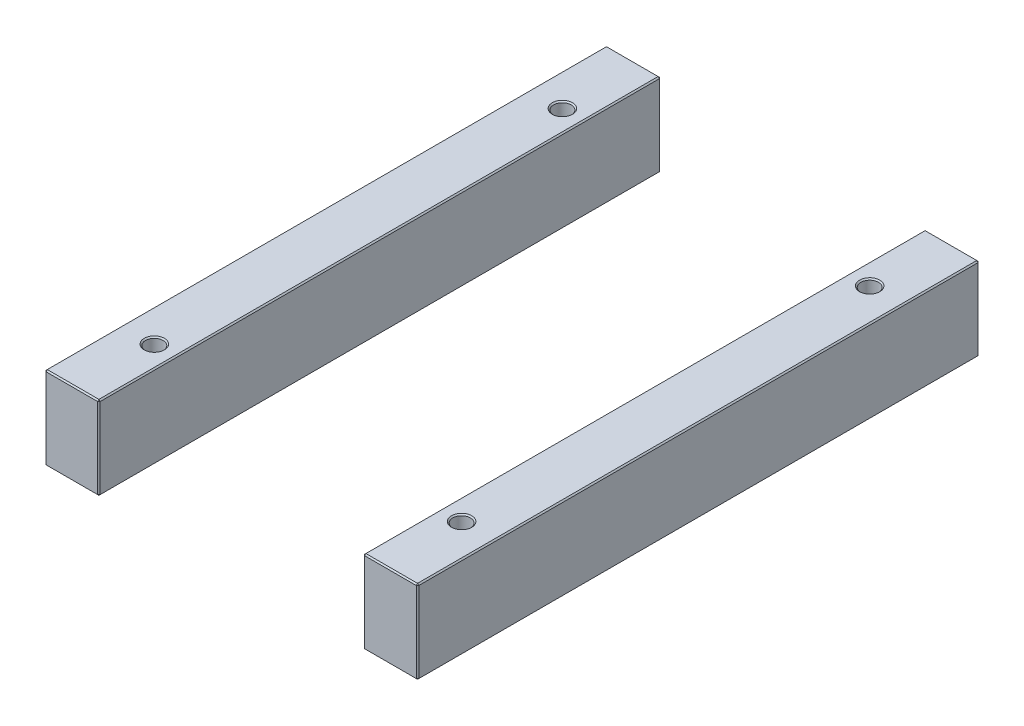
ISO-10303-21;
HEADER;
FILE_DESCRIPTION(('STEP AP214'),'2;1');
FILE_NAME('part.step','',(''),(''),'','','');
FILE_SCHEMA(('AUTOMOTIVE_DESIGN { 1 0 10303 214 1 1 1 1 }'));
ENDSEC;
DATA;
#1=APPLICATION_CONTEXT('core data for automotive mechanical design processes');
#2=APPLICATION_PROTOCOL_DEFINITION('international standard','automotive_design',2000,#1);
#3=PRODUCT_CONTEXT('',#1,'mechanical');
#4=PRODUCT('Part','Part','',(#3));
#5=PRODUCT_RELATED_PRODUCT_CATEGORY('part','',(#4));
#6=PRODUCT_DEFINITION_FORMATION('','',#4);
#7=PRODUCT_DEFINITION_CONTEXT('part definition',#1,'design');
#8=PRODUCT_DEFINITION('design','',#6,#7);
#9=PRODUCT_DEFINITION_SHAPE('','',#8);
#10=(LENGTH_UNIT() NAMED_UNIT(*) SI_UNIT(.MILLI.,.METRE.));
#11=(NAMED_UNIT(*) PLANE_ANGLE_UNIT() SI_UNIT($,.RADIAN.));
#12=(NAMED_UNIT(*) SI_UNIT($,.STERADIAN.) SOLID_ANGLE_UNIT());
#13=UNCERTAINTY_MEASURE_WITH_UNIT(LENGTH_MEASURE(1.E-05),#10,'distance_accuracy_value','');
#14=(GEOMETRIC_REPRESENTATION_CONTEXT(3) GLOBAL_UNCERTAINTY_ASSIGNED_CONTEXT((#13)) GLOBAL_UNIT_ASSIGNED_CONTEXT((#10,
#11,#12)) REPRESENTATION_CONTEXT('',''));
#15=CARTESIAN_POINT('',(0.,0.,0.));
#16=DIRECTION('',(0.,0.,1.));
#17=DIRECTION('',(1.,0.,0.));
#18=AXIS2_PLACEMENT_3D('',#15,#16,#17);
#19=CARTESIAN_POINT('',(-148.,66.,-223.));
#20=DIRECTION('',(0.,0.,1.));
#21=DIRECTION('',(1.,0.,0.));
#22=AXIS2_PLACEMENT_3D('',#19,#20,#21);
#23=PLANE('',#22);
#24=DIRECTION('',(-1.,0.,0.));
#25=VECTOR('',#24,1.);
#26=CARTESIAN_POINT('',(-148.,0.999999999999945,-223.));
#27=LINE('',#26,#25);
#28=CARTESIAN_POINT('',(-106.,0.999999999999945,-223.));
#29=VERTEX_POINT('',#28);
#30=CARTESIAN_POINT('',(-147.,0.999999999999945,-223.));
#31=VERTEX_POINT('',#30);
#32=EDGE_CURVE('P0_E137',#29,#31,#27,.T.);
#33=ORIENTED_EDGE('',*,*,#32,.T.);
#34=DIRECTION('',(0.,1.,0.));
#35=VECTOR('',#34,1.);
#36=CARTESIAN_POINT('',(-147.,66.,-223.));
#37=LINE('',#36,#35);
#38=CARTESIAN_POINT('',(-147.,65.,-223.));
#39=VERTEX_POINT('',#38);
#40=EDGE_CURVE('P0_E235',#31,#39,#37,.T.);
#41=ORIENTED_EDGE('',*,*,#40,.T.);
#42=DIRECTION('',(1.,0.,0.));
#43=VECTOR('',#42,1.);
#44=CARTESIAN_POINT('',(-148.,65.,-223.));
#45=LINE('',#44,#43);
#46=CARTESIAN_POINT('',(-106.,65.,-223.));
#47=VERTEX_POINT('',#46);
#48=EDGE_CURVE('P0_E233',#39,#47,#45,.T.);
#49=ORIENTED_EDGE('',*,*,#48,.T.);
#50=DIRECTION('',(0.,-1.,0.));
#51=VECTOR('',#50,1.);
#52=CARTESIAN_POINT('',(-106.,66.,-223.));
#53=LINE('',#52,#51);
#54=EDGE_CURVE('P0_E230',#47,#29,#53,.T.);
#55=ORIENTED_EDGE('',*,*,#54,.T.);
#56=EDGE_LOOP('',(#33,#41,#49,#55));
#57=FACE_BOUND('',#56,.T.);
#58=ADVANCED_FACE('P0_F16',(#57),#23,.F.);
#59=CARTESIAN_POINT('',(-148.,66.,223.));
#60=DIRECTION('',(1.,0.,0.));
#61=DIRECTION('',(0.,0.,-1.));
#62=AXIS2_PLACEMENT_3D('',#59,#60,#61);
#63=PLANE('',#62);
#64=DIRECTION('',(0.,1.,0.));
#65=VECTOR('',#64,1.);
#66=CARTESIAN_POINT('',(-148.,66.,222.));
#67=LINE('',#66,#65);
#68=CARTESIAN_POINT('',(-148.,0.999999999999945,222.));
#69=VERTEX_POINT('',#68);
#70=CARTESIAN_POINT('',(-148.,65.,222.));
#71=VERTEX_POINT('',#70);
#72=EDGE_CURVE('P0_E217',#69,#71,#67,.T.);
#73=ORIENTED_EDGE('',*,*,#72,.T.);
#74=DIRECTION('',(0.,0.,-1.));
#75=VECTOR('',#74,1.);
#76=CARTESIAN_POINT('',(-148.,65.,223.));
#77=LINE('',#76,#75);
#78=CARTESIAN_POINT('',(-148.,65.,-222.));
#79=VERTEX_POINT('',#78);
#80=EDGE_CURVE('P0_E228',#71,#79,#77,.T.);
#81=ORIENTED_EDGE('',*,*,#80,.T.);
#82=DIRECTION('',(0.,-1.,0.));
#83=VECTOR('',#82,1.);
#84=CARTESIAN_POINT('',(-148.,66.,-222.));
#85=LINE('',#84,#83);
#86=CARTESIAN_POINT('',(-148.,0.999999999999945,-222.));
#87=VERTEX_POINT('',#86);
#88=EDGE_CURVE('P0_E225',#79,#87,#85,.T.);
#89=ORIENTED_EDGE('',*,*,#88,.T.);
#90=DIRECTION('',(0.,0.,1.));
#91=VECTOR('',#90,1.);
#92=CARTESIAN_POINT('',(-148.,0.999999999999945,223.));
#93=LINE('',#92,#91);
#94=EDGE_CURVE('P0_E214',#87,#69,#93,.T.);
#95=ORIENTED_EDGE('',*,*,#94,.T.);
#96=EDGE_LOOP('',(#73,#81,#89,#95));
#97=FACE_BOUND('',#96,.T.);
#98=ADVANCED_FACE('P0_F302',(#97),#63,.F.);
#99=CARTESIAN_POINT('',(-148.,66.,223.));
#100=DIRECTION('',(0.,0.,-1.));
#101=DIRECTION('',(-1.,0.,0.));
#102=AXIS2_PLACEMENT_3D('',#99,#100,#101);
#103=PLANE('',#102);
#104=DIRECTION('',(-1.,0.,0.));
#105=VECTOR('',#104,1.);
#106=CARTESIAN_POINT('',(-148.,65.,223.));
#107=LINE('',#106,#105);
#108=CARTESIAN_POINT('',(-106.,65.,223.));
#109=VERTEX_POINT('',#108);
#110=CARTESIAN_POINT('',(-147.,65.,223.));
#111=VERTEX_POINT('',#110);
#112=EDGE_CURVE('P0_E242',#109,#111,#107,.T.);
#113=ORIENTED_EDGE('',*,*,#112,.T.);
#114=DIRECTION('',(0.,-1.,0.));
#115=VECTOR('',#114,1.);
#116=CARTESIAN_POINT('',(-147.,66.,223.));
#117=LINE('',#116,#115);
#118=CARTESIAN_POINT('',(-147.,0.999999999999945,223.));
#119=VERTEX_POINT('',#118);
#120=EDGE_CURVE('P0_E244',#111,#119,#117,.T.);
#121=ORIENTED_EDGE('',*,*,#120,.T.);
#122=DIRECTION('',(1.,0.,0.));
#123=VECTOR('',#122,1.);
#124=CARTESIAN_POINT('',(-105.,0.999999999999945,223.));
#125=LINE('',#124,#123);
#126=CARTESIAN_POINT('',(-106.,0.999999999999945,223.));
#127=VERTEX_POINT('',#126);
#128=EDGE_CURVE('P0_E240',#119,#127,#125,.T.);
#129=ORIENTED_EDGE('',*,*,#128,.T.);
#130=DIRECTION('',(0.,1.,0.));
#131=VECTOR('',#130,1.);
#132=CARTESIAN_POINT('',(-106.,66.,223.));
#133=LINE('',#132,#131);
#134=EDGE_CURVE('P0_E238',#127,#109,#133,.T.);
#135=ORIENTED_EDGE('',*,*,#134,.T.);
#136=EDGE_LOOP('',(#113,#121,#129,#135));
#137=FACE_BOUND('',#136,.T.);
#138=ADVANCED_FACE('P0_F341',(#137),#103,.F.);
#139=CARTESIAN_POINT('',(-105.,66.,-223.));
#140=DIRECTION('',(-1.,0.,0.));
#141=DIRECTION('',(0.,0.,1.));
#142=AXIS2_PLACEMENT_3D('',#139,#140,#141);
#143=PLANE('',#142);
#144=DIRECTION('',(0.,0.,1.));
#145=VECTOR('',#144,1.);
#146=CARTESIAN_POINT('',(-105.,65.,-223.));
#147=LINE('',#146,#145);
#148=CARTESIAN_POINT('',(-105.,65.,-222.));
#149=VERTEX_POINT('',#148);
#150=CARTESIAN_POINT('',(-105.,65.,222.));
#151=VERTEX_POINT('',#150);
#152=EDGE_CURVE('P0_E31',#149,#151,#147,.T.);
#153=ORIENTED_EDGE('',*,*,#152,.T.);
#154=DIRECTION('',(0.,-1.,0.));
#155=VECTOR('',#154,1.);
#156=CARTESIAN_POINT('',(-105.,66.,222.));
#157=LINE('',#156,#155);
#158=CARTESIAN_POINT('',(-105.,0.999999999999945,222.));
#159=VERTEX_POINT('',#158);
#160=EDGE_CURVE('P0_E190',#151,#159,#157,.T.);
#161=ORIENTED_EDGE('',*,*,#160,.T.);
#162=DIRECTION('',(0.,0.,-1.));
#163=VECTOR('',#162,1.);
#164=CARTESIAN_POINT('',(-105.,0.999999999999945,-223.));
#165=LINE('',#164,#163);
#166=CARTESIAN_POINT('',(-105.,0.999999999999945,-222.));
#167=VERTEX_POINT('',#166);
#168=EDGE_CURVE('P0_E256',#159,#167,#165,.T.);
#169=ORIENTED_EDGE('',*,*,#168,.T.);
#170=DIRECTION('',(0.,1.,0.));
#171=VECTOR('',#170,1.);
#172=CARTESIAN_POINT('',(-105.,66.,-222.));
#173=LINE('',#172,#171);
#174=EDGE_CURVE('P0_E36',#167,#149,#173,.T.);
#175=ORIENTED_EDGE('',*,*,#174,.T.);
#176=EDGE_LOOP('',(#153,#161,#169,#175));
#177=FACE_BOUND('',#176,.T.);
#178=ADVANCED_FACE('P0_F535',(#177),#143,.F.);
#179=CARTESIAN_POINT('',(0.,66.,0.));
#180=DIRECTION('',(0.,-1.,0.));
#181=DIRECTION('',(0.,0.,-1.));
#182=AXIS2_PLACEMENT_3D('',#179,#180,#181);
#183=PLANE('',#182);
#184=CARTESIAN_POINT('',(-122.,66.,162.));
#185=DIRECTION('',(0.,-1.,0.));
#186=DIRECTION('',(0.,0.,-1.));
#187=AXIS2_PLACEMENT_3D('',#184,#185,#186);
#188=CIRCLE('',#187,8.);
#189=CARTESIAN_POINT('',(-122.,66.,154.));
#190=VERTEX_POINT('',#189);
#191=EDGE_CURVE('P0_E24',#190,#190,#188,.T.);
#192=ORIENTED_EDGE('',*,*,#191,.T.);
#193=EDGE_LOOP('',(#192));
#194=FACE_BOUND('',#193,.T.);
#195=CARTESIAN_POINT('',(-122.,66.,-162.));
#196=DIRECTION('',(0.,-1.,0.));
#197=DIRECTION('',(0.,0.,-1.));
#198=AXIS2_PLACEMENT_3D('',#195,#196,#197);
#199=CIRCLE('',#198,8.);
#200=CARTESIAN_POINT('',(-122.,66.,-170.));
#201=VERTEX_POINT('',#200);
#202=EDGE_CURVE('P0_E189',#201,#201,#199,.T.);
#203=ORIENTED_EDGE('',*,*,#202,.T.);
#204=EDGE_LOOP('',(#203));
#205=FACE_BOUND('',#204,.T.);
#206=DIRECTION('',(0.,0.,1.));
#207=VECTOR('',#206,1.);
#208=CARTESIAN_POINT('',(-147.,66.,0.));
#209=LINE('',#208,#207);
#210=CARTESIAN_POINT('',(-147.,66.,-222.));
#211=VERTEX_POINT('',#210);
#212=CARTESIAN_POINT('',(-147.,66.,222.));
#213=VERTEX_POINT('',#212);
#214=EDGE_CURVE('P0_E251',#211,#213,#209,.T.);
#215=ORIENTED_EDGE('',*,*,#214,.T.);
#216=DIRECTION('',(1.,0.,0.));
#217=VECTOR('',#216,1.);
#218=CARTESIAN_POINT('',(-1.43296227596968E-13,66.,222.));
#219=LINE('',#218,#217);
#220=CARTESIAN_POINT('',(-106.,66.,222.));
#221=VERTEX_POINT('',#220);
#222=EDGE_CURVE('P0_E253',#213,#221,#219,.T.);
#223=ORIENTED_EDGE('',*,*,#222,.T.);
#224=DIRECTION('',(0.,0.,-1.));
#225=VECTOR('',#224,1.);
#226=CARTESIAN_POINT('',(-106.,66.,0.));
#227=LINE('',#226,#225);
#228=CARTESIAN_POINT('',(-106.,66.,-222.));
#229=VERTEX_POINT('',#228);
#230=EDGE_CURVE('P0_E247',#221,#229,#227,.T.);
#231=ORIENTED_EDGE('',*,*,#230,.T.);
#232=DIRECTION('',(-1.,0.,0.));
#233=VECTOR('',#232,1.);
#234=CARTESIAN_POINT('',(1.43296227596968E-13,66.,-222.));
#235=LINE('',#234,#233);
#236=EDGE_CURVE('P0_E249',#229,#211,#235,.T.);
#237=ORIENTED_EDGE('',*,*,#236,.T.);
#238=EDGE_LOOP('',(#215,#223,#231,#237));
#239=FACE_BOUND('',#238,.T.);
#240=ADVANCED_FACE('P0_F195',(#194,#205,#239),#183,.F.);
#241=CARTESIAN_POINT('',(0.,0.,0.));
#242=DIRECTION('',(0.,-1.,0.));
#243=DIRECTION('',(0.,0.,-1.));
#244=AXIS2_PLACEMENT_3D('',#241,#242,#243);
#245=PLANE('',#244);
#246=CARTESIAN_POINT('',(-122.,0.,-162.));
#247=DIRECTION('',(0.,-1.,0.));
#248=DIRECTION('',(0.,0.,-1.));
#249=AXIS2_PLACEMENT_3D('',#246,#247,#248);
#250=CIRCLE('',#249,8.);
#251=CARTESIAN_POINT('',(-122.,0.,-170.));
#252=VERTEX_POINT('',#251);
#253=EDGE_CURVE('P0_E220',#252,#252,#250,.F.);
#254=ORIENTED_EDGE('',*,*,#253,.T.);
#255=EDGE_LOOP('',(#254));
#256=FACE_BOUND('',#255,.T.);
#257=CARTESIAN_POINT('',(-122.,0.,162.));
#258=DIRECTION('',(0.,-1.,0.));
#259=DIRECTION('',(0.,0.,-1.));
#260=AXIS2_PLACEMENT_3D('',#257,#258,#259);
#261=CIRCLE('',#260,8.);
#262=CARTESIAN_POINT('',(-122.,0.,154.));
#263=VERTEX_POINT('',#262);
#264=EDGE_CURVE('P0_E608',#263,#263,#261,.F.);
#265=ORIENTED_EDGE('',*,*,#264,.T.);
#266=EDGE_LOOP('',(#265));
#267=FACE_BOUND('',#266,.T.);
#268=DIRECTION('',(-1.,0.,0.));
#269=VECTOR('',#268,1.);
#270=CARTESIAN_POINT('',(-148.,0.,222.));
#271=LINE('',#270,#269);
#272=CARTESIAN_POINT('',(-106.,0.,222.));
#273=VERTEX_POINT('',#272);
#274=CARTESIAN_POINT('',(-147.,0.,222.));
#275=VERTEX_POINT('',#274);
#276=EDGE_CURVE('P0_E114',#273,#275,#271,.T.);
#277=ORIENTED_EDGE('',*,*,#276,.T.);
#278=DIRECTION('',(0.,0.,-1.));
#279=VECTOR('',#278,1.);
#280=CARTESIAN_POINT('',(-147.,0.,-223.));
#281=LINE('',#280,#279);
#282=CARTESIAN_POINT('',(-147.,0.,-222.));
#283=VERTEX_POINT('',#282);
#284=EDGE_CURVE('P0_E110',#275,#283,#281,.T.);
#285=ORIENTED_EDGE('',*,*,#284,.T.);
#286=DIRECTION('',(1.,0.,0.));
#287=VECTOR('',#286,1.);
#288=CARTESIAN_POINT('',(-105.,0.,-222.));
#289=LINE('',#288,#287);
#290=CARTESIAN_POINT('',(-106.,0.,-222.));
#291=VERTEX_POINT('',#290);
#292=EDGE_CURVE('P0_E104',#283,#291,#289,.T.);
#293=ORIENTED_EDGE('',*,*,#292,.T.);
#294=DIRECTION('',(0.,0.,1.));
#295=VECTOR('',#294,1.);
#296=CARTESIAN_POINT('',(-106.,0.,223.));
#297=LINE('',#296,#295);
#298=EDGE_CURVE('P0_E107',#291,#273,#297,.T.);
#299=ORIENTED_EDGE('',*,*,#298,.T.);
#300=EDGE_LOOP('',(#277,#285,#293,#299));
#301=FACE_BOUND('',#300,.T.);
#302=ADVANCED_FACE('P0_F106',(#256,#267,#301),#245,.T.);
#303=CARTESIAN_POINT('',(-122.,0.,-162.));
#304=DIRECTION('',(0.,1.,0.));
#305=DIRECTION('',(0.,0.,1.));
#306=AXIS2_PLACEMENT_3D('',#303,#304,#305);
#307=CYLINDRICAL_SURFACE('',#306,7.);
#308=CARTESIAN_POINT('',(-122.,65.,-162.));
#309=DIRECTION('',(0.,-1.,0.));
#310=DIRECTION('',(0.,0.,-1.));
#311=AXIS2_PLACEMENT_3D('',#308,#309,#310);
#312=CIRCLE('',#311,7.);
#313=CARTESIAN_POINT('',(-122.,65.,-169.));
#314=VERTEX_POINT('',#313);
#315=EDGE_CURVE('P0_E10',#314,#314,#312,.F.);
#316=ORIENTED_EDGE('',*,*,#315,.T.);
#317=EDGE_LOOP('',(#316));
#318=FACE_BOUND('',#317,.T.);
#319=CARTESIAN_POINT('',(-122.,0.999999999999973,-162.));
#320=DIRECTION('',(0.,-1.,0.));
#321=DIRECTION('',(0.,0.,-1.));
#322=AXIS2_PLACEMENT_3D('',#319,#320,#321);
#323=CIRCLE('',#322,7.);
#324=CARTESIAN_POINT('',(-122.,0.999999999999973,-169.));
#325=VERTEX_POINT('',#324);
#326=EDGE_CURVE('P0_E215',#325,#325,#323,.T.);
#327=ORIENTED_EDGE('',*,*,#326,.T.);
#328=EDGE_LOOP('',(#327));
#329=FACE_BOUND('',#328,.T.);
#330=ADVANCED_FACE('P0_F208',(#318,#329),#307,.F.);
#331=CARTESIAN_POINT('',(-122.,0.,162.));
#332=DIRECTION('',(0.,1.,0.));
#333=DIRECTION('',(0.,0.,1.));
#334=AXIS2_PLACEMENT_3D('',#331,#332,#333);
#335=CYLINDRICAL_SURFACE('',#334,7.);
#336=CARTESIAN_POINT('',(-122.,65.,162.));
#337=DIRECTION('',(0.,-1.,0.));
#338=DIRECTION('',(0.,0.,-1.));
#339=AXIS2_PLACEMENT_3D('',#336,#337,#338);
#340=CIRCLE('',#339,7.);
#341=CARTESIAN_POINT('',(-122.,65.,155.));
#342=VERTEX_POINT('',#341);
#343=EDGE_CURVE('P0_E186',#342,#342,#340,.F.);
#344=ORIENTED_EDGE('',*,*,#343,.T.);
#345=EDGE_LOOP('',(#344));
#346=FACE_BOUND('',#345,.T.);
#347=CARTESIAN_POINT('',(-122.,1.00000000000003,162.));
#348=DIRECTION('',(0.,-1.,0.));
#349=DIRECTION('',(0.,0.,-1.));
#350=AXIS2_PLACEMENT_3D('',#347,#348,#349);
#351=CIRCLE('',#350,7.);
#352=CARTESIAN_POINT('',(-122.,1.00000000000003,155.));
#353=VERTEX_POINT('',#352);
#354=EDGE_CURVE('P0_E212',#353,#353,#351,.T.);
#355=ORIENTED_EDGE('',*,*,#354,.T.);
#356=EDGE_LOOP('',(#355));
#357=FACE_BOUND('',#356,.T.);
#358=ADVANCED_FACE('P0_F204',(#346,#357),#335,.F.);
#359=CARTESIAN_POINT('',(-122.,0.,-162.));
#360=DIRECTION('',(0.,-1.,0.));
#361=DIRECTION('',(0.,0.,-1.));
#362=AXIS2_PLACEMENT_3D('',#359,#360,#361);
#363=CONICAL_SURFACE('',#362,8.,0.785398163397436);
#364=ORIENTED_EDGE('',*,*,#326,.F.);
#365=EDGE_LOOP('',(#364));
#366=FACE_BOUND('',#365,.T.);
#367=ORIENTED_EDGE('',*,*,#253,.F.);
#368=EDGE_LOOP('',(#367));
#369=FACE_BOUND('',#368,.T.);
#370=ADVANCED_FACE('P0_F207',(#366,#369),#363,.F.);
#371=CARTESIAN_POINT('',(-122.,0.,162.));
#372=DIRECTION('',(0.,-1.,0.));
#373=DIRECTION('',(0.,0.,-1.));
#374=AXIS2_PLACEMENT_3D('',#371,#372,#373);
#375=CONICAL_SURFACE('',#374,8.,0.785398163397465);
#376=ORIENTED_EDGE('',*,*,#354,.F.);
#377=EDGE_LOOP('',(#376));
#378=FACE_BOUND('',#377,.T.);
#379=ORIENTED_EDGE('',*,*,#264,.F.);
#380=EDGE_LOOP('',(#379));
#381=FACE_BOUND('',#380,.T.);
#382=ADVANCED_FACE('P0_F347',(#378,#381),#375,.F.);
#383=CARTESIAN_POINT('',(-105.,66.,222.));
#384=DIRECTION('',(-0.707106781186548,0.,-0.707106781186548));
#385=DIRECTION('',(0.,-1.,0.));
#386=AXIS2_PLACEMENT_3D('',#383,#384,#385);
#387=PLANE('',#386);
#388=DIRECTION('',(-0.707106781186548,0.,0.707106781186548));
#389=VECTOR('',#388,1.);
#390=CARTESIAN_POINT('',(-105.5,65.,222.5));
#391=LINE('',#390,#389);
#392=EDGE_CURVE('P0_E125',#109,#151,#391,.F.);
#393=ORIENTED_EDGE('',*,*,#392,.F.);
#394=ORIENTED_EDGE('',*,*,#134,.F.);
#395=DIRECTION('',(0.707106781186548,0.,-0.707106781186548));
#396=VECTOR('',#395,1.);
#397=CARTESIAN_POINT('',(-106.,0.999999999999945,223.));
#398=LINE('',#397,#396);
#399=EDGE_CURVE('P0_E181',#159,#127,#398,.F.);
#400=ORIENTED_EDGE('',*,*,#399,.F.);
#401=ORIENTED_EDGE('',*,*,#160,.F.);
#402=EDGE_LOOP('',(#393,#394,#400,#401));
#403=FACE_BOUND('',#402,.T.);
#404=ADVANCED_FACE('P0_F351',(#403),#387,.F.);
#405=CARTESIAN_POINT('',(-106.,66.,222.));
#406=DIRECTION('',(0.577350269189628,0.577350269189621,0.577350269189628));
#407=DIRECTION('',(0.707106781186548,0.,-0.707106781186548));
#408=AXIS2_PLACEMENT_3D('',#405,#406,#407);
#409=PLANE('',#408);
#410=DIRECTION('',(0.,0.707106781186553,-0.707106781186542));
#411=VECTOR('',#410,1.);
#412=CARTESIAN_POINT('',(-106.,66.,222.));
#413=LINE('',#412,#411);
#414=EDGE_CURVE('P0_E175',#109,#221,#413,.T.);
#415=ORIENTED_EDGE('',*,*,#414,.F.);
#416=ORIENTED_EDGE('',*,*,#392,.T.);
#417=DIRECTION('',(0.707106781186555,-0.70710678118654,0.));
#418=VECTOR('',#417,1.);
#419=CARTESIAN_POINT('',(-106.,66.,222.));
#420=LINE('',#419,#418);
#421=EDGE_CURVE('P0_E178',#221,#151,#420,.T.);
#422=ORIENTED_EDGE('',*,*,#421,.F.);
#423=EDGE_LOOP('',(#415,#416,#422));
#424=FACE_BOUND('',#423,.T.);
#425=ADVANCED_FACE('P0_F487',(#424),#409,.T.);
#426=CARTESIAN_POINT('',(-106.,0.999999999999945,223.));
#427=DIRECTION('',(0.577350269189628,-0.577350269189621,0.577350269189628));
#428=DIRECTION('',(0.707106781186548,0.,-0.707106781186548));
#429=AXIS2_PLACEMENT_3D('',#426,#427,#428);
#430=PLANE('',#429);
#431=DIRECTION('',(0.707106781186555,0.70710678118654,0.));
#432=VECTOR('',#431,1.);
#433=CARTESIAN_POINT('',(-105.5,0.499999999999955,222.));
#434=LINE('',#433,#432);
#435=EDGE_CURVE('P0_E123',#159,#273,#434,.F.);
#436=ORIENTED_EDGE('',*,*,#435,.F.);
#437=ORIENTED_EDGE('',*,*,#399,.T.);
#438=DIRECTION('',(0.,-0.707106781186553,-0.707106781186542));
#439=VECTOR('',#438,1.);
#440=CARTESIAN_POINT('',(-106.,0.999999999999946,223.));
#441=LINE('',#440,#439);
#442=EDGE_CURVE('P0_E172',#273,#127,#441,.F.);
#443=ORIENTED_EDGE('',*,*,#442,.F.);
#444=EDGE_LOOP('',(#436,#437,#443));
#445=FACE_BOUND('',#444,.T.);
#446=ADVANCED_FACE('P0_F478',(#445),#430,.T.);
#447=CARTESIAN_POINT('',(-106.,66.,0.));
#448=DIRECTION('',(-0.70710678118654,-0.707106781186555,0.));
#449=DIRECTION('',(0.,0.,-1.));
#450=AXIS2_PLACEMENT_3D('',#447,#448,#449);
#451=PLANE('',#450);
#452=ORIENTED_EDGE('',*,*,#421,.T.);
#453=ORIENTED_EDGE('',*,*,#152,.F.);
#454=DIRECTION('',(-0.707106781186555,0.70710678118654,0.));
#455=VECTOR('',#454,1.);
#456=CARTESIAN_POINT('',(-105.5,65.5,-222.));
#457=LINE('',#456,#455);
#458=EDGE_CURVE('P0_E165',#229,#149,#457,.F.);
#459=ORIENTED_EDGE('',*,*,#458,.F.);
#460=ORIENTED_EDGE('',*,*,#230,.F.);
#461=EDGE_LOOP('',(#452,#453,#459,#460));
#462=FACE_BOUND('',#461,.T.);
#463=ADVANCED_FACE('P0_F318',(#462),#451,.F.);
#464=CARTESIAN_POINT('',(-1.43296227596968E-13,66.,222.));
#465=DIRECTION('',(0.,-0.707106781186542,-0.707106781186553));
#466=DIRECTION('',(1.,0.,0.));
#467=AXIS2_PLACEMENT_3D('',#464,#465,#466);
#468=PLANE('',#467);
#469=ORIENTED_EDGE('',*,*,#414,.T.);
#470=ORIENTED_EDGE('',*,*,#222,.F.);
#471=DIRECTION('',(0.,-0.707106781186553,0.707106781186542));
#472=VECTOR('',#471,1.);
#473=CARTESIAN_POINT('',(-147.,65.5,222.5));
#474=LINE('',#473,#472);
#475=EDGE_CURVE('P0_E162',#111,#213,#474,.F.);
#476=ORIENTED_EDGE('',*,*,#475,.F.);
#477=ORIENTED_EDGE('',*,*,#112,.F.);
#478=EDGE_LOOP('',(#469,#470,#476,#477));
#479=FACE_BOUND('',#478,.T.);
#480=ADVANCED_FACE('P0_F313',(#479),#468,.F.);
#481=CARTESIAN_POINT('',(-147.,66.,223.));
#482=DIRECTION('',(0.707106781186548,0.,-0.707106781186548));
#483=DIRECTION('',(0.,-1.,0.));
#484=AXIS2_PLACEMENT_3D('',#481,#482,#483);
#485=PLANE('',#484);
#486=DIRECTION('',(0.707106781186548,0.,0.707106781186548));
#487=VECTOR('',#486,1.);
#488=CARTESIAN_POINT('',(-147.,0.999999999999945,223.));
#489=LINE('',#488,#487);
#490=EDGE_CURVE('P0_E156',#119,#69,#489,.F.);
#491=ORIENTED_EDGE('',*,*,#490,.F.);
#492=ORIENTED_EDGE('',*,*,#120,.F.);
#493=DIRECTION('',(-0.707106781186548,0.,-0.707106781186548));
#494=VECTOR('',#493,1.);
#495=CARTESIAN_POINT('',(-148.,65.,222.));
#496=LINE('',#495,#494);
#497=EDGE_CURVE('P0_E159',#71,#111,#496,.F.);
#498=ORIENTED_EDGE('',*,*,#497,.F.);
#499=ORIENTED_EDGE('',*,*,#72,.F.);
#500=EDGE_LOOP('',(#491,#492,#498,#499));
#501=FACE_BOUND('',#500,.T.);
#502=ADVANCED_FACE('P0_F307',(#501),#485,.F.);
#503=CARTESIAN_POINT('',(-148.,0.999999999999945,223.));
#504=DIRECTION('',(0.,-0.707106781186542,0.707106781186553));
#505=DIRECTION('',(-1.,0.,0.));
#506=AXIS2_PLACEMENT_3D('',#503,#504,#505);
#507=PLANE('',#506);
#508=ORIENTED_EDGE('',*,*,#442,.T.);
#509=ORIENTED_EDGE('',*,*,#128,.F.);
#510=DIRECTION('',(0.,0.707106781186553,0.707106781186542));
#511=VECTOR('',#510,1.);
#512=CARTESIAN_POINT('',(-147.,0.999999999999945,223.));
#513=LINE('',#512,#511);
#514=EDGE_CURVE('P0_E134',#275,#119,#513,.T.);
#515=ORIENTED_EDGE('',*,*,#514,.F.);
#516=ORIENTED_EDGE('',*,*,#276,.F.);
#517=EDGE_LOOP('',(#508,#509,#515,#516));
#518=FACE_BOUND('',#517,.T.);
#519=ADVANCED_FACE('P0_F333',(#518),#507,.T.);
#520=CARTESIAN_POINT('',(-105.,0.999999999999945,-223.));
#521=DIRECTION('',(0.70710678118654,-0.707106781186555,0.));
#522=DIRECTION('',(0.,0.,1.));
#523=AXIS2_PLACEMENT_3D('',#520,#521,#522);
#524=PLANE('',#523);
#525=ORIENTED_EDGE('',*,*,#435,.T.);
#526=ORIENTED_EDGE('',*,*,#298,.F.);
#527=DIRECTION('',(-0.707106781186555,-0.70710678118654,0.));
#528=VECTOR('',#527,1.);
#529=CARTESIAN_POINT('',(-106.,0.,-222.));
#530=LINE('',#529,#528);
#531=EDGE_CURVE('P0_E120',#167,#291,#530,.T.);
#532=ORIENTED_EDGE('',*,*,#531,.F.);
#533=ORIENTED_EDGE('',*,*,#168,.F.);
#534=EDGE_LOOP('',(#525,#526,#532,#533));
#535=FACE_BOUND('',#534,.T.);
#536=ADVANCED_FACE('P0_F119',(#535),#524,.T.);
#537=CARTESIAN_POINT('',(-106.,66.,-223.));
#538=DIRECTION('',(-0.707106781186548,0.,0.707106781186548));
#539=DIRECTION('',(0.,-1.,0.));
#540=AXIS2_PLACEMENT_3D('',#537,#538,#539);
#541=PLANE('',#540);
#542=DIRECTION('',(0.707106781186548,0.,0.707106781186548));
#543=VECTOR('',#542,1.);
#544=CARTESIAN_POINT('',(-106.,65.,-223.));
#545=LINE('',#544,#543);
#546=EDGE_CURVE('P0_E168',#149,#47,#545,.F.);
#547=ORIENTED_EDGE('',*,*,#546,.F.);
#548=ORIENTED_EDGE('',*,*,#174,.F.);
#549=DIRECTION('',(-0.707106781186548,0.,-0.707106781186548));
#550=VECTOR('',#549,1.);
#551=CARTESIAN_POINT('',(-105.5,0.999999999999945,-222.5));
#552=LINE('',#551,#550);
#553=EDGE_CURVE('P0_E133',#29,#167,#552,.F.);
#554=ORIENTED_EDGE('',*,*,#553,.F.);
#555=ORIENTED_EDGE('',*,*,#54,.F.);
#556=EDGE_LOOP('',(#547,#548,#554,#555));
#557=FACE_BOUND('',#556,.T.);
#558=ADVANCED_FACE('P0_F323',(#557),#541,.F.);
#559=CARTESIAN_POINT('',(-106.,65.,-223.));
#560=DIRECTION('',(0.577350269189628,0.577350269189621,-0.577350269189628));
#561=DIRECTION('',(-0.707106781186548,0.,-0.707106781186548));
#562=AXIS2_PLACEMENT_3D('',#559,#560,#561);
#563=PLANE('',#562);
#564=ORIENTED_EDGE('',*,*,#458,.T.);
#565=ORIENTED_EDGE('',*,*,#546,.T.);
#566=DIRECTION('',(0.,-0.707106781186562,-0.707106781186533));
#567=VECTOR('',#566,1.);
#568=CARTESIAN_POINT('',(-106.,65.,-223.));
#569=LINE('',#568,#567);
#570=EDGE_CURVE('P0_E151',#229,#47,#569,.T.);
#571=ORIENTED_EDGE('',*,*,#570,.F.);
#572=EDGE_LOOP('',(#564,#565,#571));
#573=FACE_BOUND('',#572,.T.);
#574=ADVANCED_FACE('P0_F321',(#573),#563,.T.);
#575=CARTESIAN_POINT('',(-148.,65.,222.));
#576=DIRECTION('',(-0.577350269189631,0.577350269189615,0.577350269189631));
#577=DIRECTION('',(0.707106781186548,0.,0.707106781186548));
#578=AXIS2_PLACEMENT_3D('',#575,#576,#577);
#579=PLANE('',#578);
#580=ORIENTED_EDGE('',*,*,#497,.T.);
#581=ORIENTED_EDGE('',*,*,#475,.T.);
#582=DIRECTION('',(0.707106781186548,0.707106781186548,0.));
#583=VECTOR('',#582,1.);
#584=CARTESIAN_POINT('',(-148.,65.,222.));
#585=LINE('',#584,#583);
#586=EDGE_CURVE('P0_E142',#71,#213,#585,.T.);
#587=ORIENTED_EDGE('',*,*,#586,.F.);
#588=EDGE_LOOP('',(#580,#581,#587));
#589=FACE_BOUND('',#588,.T.);
#590=ADVANCED_FACE('P0_F310',(#589),#579,.T.);
#591=CARTESIAN_POINT('',(-147.,0.999999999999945,223.));
#592=DIRECTION('',(-0.577350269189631,-0.577350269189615,0.577350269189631));
#593=DIRECTION('',(0.707106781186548,0.,0.707106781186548));
#594=AXIS2_PLACEMENT_3D('',#591,#592,#593);
#595=PLANE('',#594);
#596=ORIENTED_EDGE('',*,*,#514,.T.);
#597=ORIENTED_EDGE('',*,*,#490,.T.);
#598=DIRECTION('',(0.707106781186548,-0.707106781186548,0.));
#599=VECTOR('',#598,1.);
#600=CARTESIAN_POINT('',(-147.5,0.499999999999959,222.));
#601=LINE('',#600,#599);
#602=EDGE_CURVE('P0_E138',#275,#69,#601,.F.);
#603=ORIENTED_EDGE('',*,*,#602,.F.);
#604=EDGE_LOOP('',(#596,#597,#603));
#605=FACE_BOUND('',#604,.T.);
#606=ADVANCED_FACE('P0_F368',(#605),#595,.T.);
#607=CARTESIAN_POINT('',(-106.,0.,-222.));
#608=DIRECTION('',(0.577350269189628,-0.577350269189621,-0.577350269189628));
#609=DIRECTION('',(-0.707106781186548,0.,-0.707106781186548));
#610=AXIS2_PLACEMENT_3D('',#607,#608,#609);
#611=PLANE('',#610);
#612=ORIENTED_EDGE('',*,*,#553,.T.);
#613=ORIENTED_EDGE('',*,*,#531,.T.);
#614=DIRECTION('',(0.,0.707106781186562,-0.707106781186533));
#615=VECTOR('',#614,1.);
#616=CARTESIAN_POINT('',(-106.,0.,-222.));
#617=LINE('',#616,#615);
#618=EDGE_CURVE('P0_E130',#29,#291,#617,.F.);
#619=ORIENTED_EDGE('',*,*,#618,.F.);
#620=EDGE_LOOP('',(#612,#613,#619));
#621=FACE_BOUND('',#620,.T.);
#622=ADVANCED_FACE('P0_F129',(#621),#611,.T.);
#623=CARTESIAN_POINT('',(1.43296227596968E-13,66.,-222.));
#624=DIRECTION('',(0.,-0.707106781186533,0.707106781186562));
#625=DIRECTION('',(-1.,0.,0.));
#626=AXIS2_PLACEMENT_3D('',#623,#624,#625);
#627=PLANE('',#626);
#628=ORIENTED_EDGE('',*,*,#570,.T.);
#629=ORIENTED_EDGE('',*,*,#48,.F.);
#630=DIRECTION('',(0.,0.707106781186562,0.707106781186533));
#631=VECTOR('',#630,1.);
#632=CARTESIAN_POINT('',(-147.,65.,-223.));
#633=LINE('',#632,#631);
#634=EDGE_CURVE('P0_E139',#211,#39,#633,.F.);
#635=ORIENTED_EDGE('',*,*,#634,.F.);
#636=ORIENTED_EDGE('',*,*,#236,.F.);
#637=EDGE_LOOP('',(#628,#629,#635,#636));
#638=FACE_BOUND('',#637,.T.);
#639=ADVANCED_FACE('P0_F286',(#638),#627,.F.);
#640=CARTESIAN_POINT('',(-147.,66.,0.));
#641=DIRECTION('',(0.707106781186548,-0.707106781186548,0.));
#642=DIRECTION('',(0.,0.,1.));
#643=AXIS2_PLACEMENT_3D('',#640,#641,#642);
#644=PLANE('',#643);
#645=ORIENTED_EDGE('',*,*,#586,.T.);
#646=ORIENTED_EDGE('',*,*,#214,.F.);
#647=DIRECTION('',(-0.707106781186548,-0.707106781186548,0.));
#648=VECTOR('',#647,1.);
#649=CARTESIAN_POINT('',(-147.5,65.5,-222.));
#650=LINE('',#649,#648);
#651=EDGE_CURVE('P0_E145',#79,#211,#650,.F.);
#652=ORIENTED_EDGE('',*,*,#651,.F.);
#653=ORIENTED_EDGE('',*,*,#80,.F.);
#654=EDGE_LOOP('',(#645,#646,#652,#653));
#655=FACE_BOUND('',#654,.T.);
#656=ADVANCED_FACE('P0_F280',(#655),#644,.F.);
#657=CARTESIAN_POINT('',(-148.,0.999999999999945,223.));
#658=DIRECTION('',(-0.707106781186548,-0.707106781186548,0.));
#659=DIRECTION('',(0.,0.,-1.));
#660=AXIS2_PLACEMENT_3D('',#657,#658,#659);
#661=PLANE('',#660);
#662=ORIENTED_EDGE('',*,*,#602,.T.);
#663=ORIENTED_EDGE('',*,*,#94,.F.);
#664=DIRECTION('',(-0.707106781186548,0.707106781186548,0.));
#665=VECTOR('',#664,1.);
#666=CARTESIAN_POINT('',(-148.,0.999999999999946,-222.));
#667=LINE('',#666,#665);
#668=EDGE_CURVE('P0_E267',#283,#87,#667,.T.);
#669=ORIENTED_EDGE('',*,*,#668,.F.);
#670=ORIENTED_EDGE('',*,*,#284,.F.);
#671=EDGE_LOOP('',(#662,#663,#669,#670));
#672=FACE_BOUND('',#671,.T.);
#673=ADVANCED_FACE('P0_F298',(#672),#661,.T.);
#674=CARTESIAN_POINT('',(-148.,0.999999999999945,-223.));
#675=DIRECTION('',(0.,-0.707106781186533,-0.707106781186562));
#676=DIRECTION('',(1.,0.,0.));
#677=AXIS2_PLACEMENT_3D('',#674,#675,#676);
#678=PLANE('',#677);
#679=ORIENTED_EDGE('',*,*,#618,.T.);
#680=ORIENTED_EDGE('',*,*,#292,.F.);
#681=DIRECTION('',(0.,-0.707106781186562,0.707106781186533));
#682=VECTOR('',#681,1.);
#683=CARTESIAN_POINT('',(-147.,0.499999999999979,-222.5));
#684=LINE('',#683,#682);
#685=EDGE_CURVE('P0_E265',#31,#283,#684,.T.);
#686=ORIENTED_EDGE('',*,*,#685,.F.);
#687=ORIENTED_EDGE('',*,*,#32,.F.);
#688=EDGE_LOOP('',(#679,#680,#686,#687));
#689=FACE_BOUND('',#688,.T.);
#690=ADVANCED_FACE('P0_F136',(#689),#678,.T.);
#691=CARTESIAN_POINT('',(-147.,65.,-223.));
#692=DIRECTION('',(-0.577350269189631,0.577350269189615,-0.577350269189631));
#693=DIRECTION('',(-0.707106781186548,0.,0.707106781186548));
#694=AXIS2_PLACEMENT_3D('',#691,#692,#693);
#695=PLANE('',#694);
#696=ORIENTED_EDGE('',*,*,#651,.T.);
#697=ORIENTED_EDGE('',*,*,#634,.T.);
#698=DIRECTION('',(0.707106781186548,0.,-0.707106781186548));
#699=VECTOR('',#698,1.);
#700=CARTESIAN_POINT('',(-147.,65.,-223.));
#701=LINE('',#700,#699);
#702=EDGE_CURVE('P0_E263',#79,#39,#701,.T.);
#703=ORIENTED_EDGE('',*,*,#702,.F.);
#704=EDGE_LOOP('',(#696,#697,#703));
#705=FACE_BOUND('',#704,.T.);
#706=ADVANCED_FACE('P0_F273',(#705),#695,.T.);
#707=CARTESIAN_POINT('',(-148.,0.999999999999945,-222.));
#708=DIRECTION('',(-0.577350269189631,-0.577350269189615,-0.577350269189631));
#709=DIRECTION('',(-0.707106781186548,0.,0.707106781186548));
#710=AXIS2_PLACEMENT_3D('',#707,#708,#709);
#711=PLANE('',#710);
#712=ORIENTED_EDGE('',*,*,#685,.T.);
#713=ORIENTED_EDGE('',*,*,#668,.T.);
#714=DIRECTION('',(-0.707106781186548,0.,0.707106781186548));
#715=VECTOR('',#714,1.);
#716=CARTESIAN_POINT('',(-148.,0.999999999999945,-222.));
#717=LINE('',#716,#715);
#718=EDGE_CURVE('P0_E261',#31,#87,#717,.T.);
#719=ORIENTED_EDGE('',*,*,#718,.F.);
#720=EDGE_LOOP('',(#712,#713,#719));
#721=FACE_BOUND('',#720,.T.);
#722=ADVANCED_FACE('P0_F294',(#721),#711,.T.);
#723=CARTESIAN_POINT('',(-148.,66.,-222.));
#724=DIRECTION('',(0.707106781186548,0.,0.707106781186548));
#725=DIRECTION('',(0.,-1.,0.));
#726=AXIS2_PLACEMENT_3D('',#723,#724,#725);
#727=PLANE('',#726);
#728=ORIENTED_EDGE('',*,*,#702,.T.);
#729=ORIENTED_EDGE('',*,*,#40,.F.);
#730=ORIENTED_EDGE('',*,*,#718,.T.);
#731=ORIENTED_EDGE('',*,*,#88,.F.);
#732=EDGE_LOOP('',(#728,#729,#730,#731));
#733=FACE_BOUND('',#732,.T.);
#734=ADVANCED_FACE('P0_F201',(#733),#727,.F.);
#735=CARTESIAN_POINT('',(-122.,65.,162.));
#736=DIRECTION('',(0.,1.,0.));
#737=DIRECTION('',(0.,0.,1.));
#738=AXIS2_PLACEMENT_3D('',#735,#736,#737);
#739=CONICAL_SURFACE('',#738,7.,0.785398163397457);
#740=ORIENTED_EDGE('',*,*,#191,.F.);
#741=EDGE_LOOP('',(#740));
#742=FACE_BOUND('',#741,.T.);
#743=ORIENTED_EDGE('',*,*,#343,.F.);
#744=EDGE_LOOP('',(#743));
#745=FACE_BOUND('',#744,.T.);
#746=ADVANCED_FACE('P0_F198',(#742,#745),#739,.F.);
#747=CARTESIAN_POINT('',(-122.,65.,-162.));
#748=DIRECTION('',(0.,1.,0.));
#749=DIRECTION('',(0.,0.,1.));
#750=AXIS2_PLACEMENT_3D('',#747,#748,#749);
#751=CONICAL_SURFACE('',#750,7.,0.785398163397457);
#752=ORIENTED_EDGE('',*,*,#202,.F.);
#753=EDGE_LOOP('',(#752));
#754=FACE_BOUND('',#753,.T.);
#755=ORIENTED_EDGE('',*,*,#315,.F.);
#756=EDGE_LOOP('',(#755));
#757=FACE_BOUND('',#756,.T.);
#758=ADVANCED_FACE('P0_F18',(#754,#757),#751,.F.);
#759=CLOSED_SHELL('',(#58,#98,#138,#178,#240,#302,#330,#358,#370,#382,#404,#425,#446,#463,#480,
#502,#519,#536,#558,#574,#590,#606,#622,#639,#656,#673,#690,#706,#722,#734,#746,#758));
#760=MANIFOLD_SOLID_BREP('P0_B1',#759);
#761=CARTESIAN_POINT('',(148.,66.,223.));
#762=DIRECTION('',(0.,0.,-1.));
#763=DIRECTION('',(-1.,0.,0.));
#764=AXIS2_PLACEMENT_3D('',#761,#762,#763);
#765=PLANE('',#764);
#766=DIRECTION('',(0.,-1.,0.));
#767=VECTOR('',#766,1.);
#768=CARTESIAN_POINT('',(106.,66.,223.));
#769=LINE('',#768,#767);
#770=CARTESIAN_POINT('',(106.,65.,223.));
#771=VERTEX_POINT('',#770);
#772=CARTESIAN_POINT('',(106.,1.00000000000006,223.));
#773=VERTEX_POINT('',#772);
#774=EDGE_CURVE('P1_E174',#771,#773,#769,.T.);
#775=ORIENTED_EDGE('',*,*,#774,.T.);
#776=DIRECTION('',(1.,0.,0.));
#777=VECTOR('',#776,1.);
#778=CARTESIAN_POINT('',(148.,1.00000000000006,223.));
#779=LINE('',#778,#777);
#780=CARTESIAN_POINT('',(147.,1.00000000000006,223.));
#781=VERTEX_POINT('',#780);
#782=EDGE_CURVE('P1_E176',#773,#781,#779,.T.);
#783=ORIENTED_EDGE('',*,*,#782,.T.);
#784=DIRECTION('',(0.,1.,0.));
#785=VECTOR('',#784,1.);
#786=CARTESIAN_POINT('',(147.,66.,223.));
#787=LINE('',#786,#785);
#788=CARTESIAN_POINT('',(147.,65.,223.));
#789=VERTEX_POINT('',#788);
#790=EDGE_CURVE('P1_E172',#781,#789,#787,.T.);
#791=ORIENTED_EDGE('',*,*,#790,.T.);
#792=DIRECTION('',(-1.,0.,0.));
#793=VECTOR('',#792,1.);
#794=CARTESIAN_POINT('',(105.,65.,223.));
#795=LINE('',#794,#793);
#796=EDGE_CURVE('P1_E170',#789,#771,#795,.T.);
#797=ORIENTED_EDGE('',*,*,#796,.T.);
#798=EDGE_LOOP('',(#775,#783,#791,#797));
#799=FACE_BOUND('',#798,.T.);
#800=ADVANCED_FACE('P1_F17',(#799),#765,.F.);
#801=CARTESIAN_POINT('',(148.,66.,223.));
#802=DIRECTION('',(-1.,0.,0.));
#803=DIRECTION('',(0.,0.,1.));
#804=AXIS2_PLACEMENT_3D('',#801,#802,#803);
#805=PLANE('',#804);
#806=DIRECTION('',(0.,0.,1.));
#807=VECTOR('',#806,1.);
#808=CARTESIAN_POINT('',(148.,65.,223.));
#809=LINE('',#808,#807);
#810=CARTESIAN_POINT('',(148.,65.,-222.));
#811=VERTEX_POINT('',#810);
#812=CARTESIAN_POINT('',(148.,65.,222.));
#813=VERTEX_POINT('',#812);
#814=EDGE_CURVE('P1_E188',#811,#813,#809,.T.);
#815=ORIENTED_EDGE('',*,*,#814,.T.);
#816=DIRECTION('',(0.,-1.,0.));
#817=VECTOR('',#816,1.);
#818=CARTESIAN_POINT('',(148.,66.,222.));
#819=LINE('',#818,#817);
#820=CARTESIAN_POINT('',(148.,1.00000000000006,222.));
#821=VERTEX_POINT('',#820);
#822=EDGE_CURVE('P1_E194',#813,#821,#819,.T.);
#823=ORIENTED_EDGE('',*,*,#822,.T.);
#824=DIRECTION('',(0.,0.,-1.));
#825=VECTOR('',#824,1.);
#826=CARTESIAN_POINT('',(148.,1.00000000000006,223.));
#827=LINE('',#826,#825);
#828=CARTESIAN_POINT('',(148.,1.00000000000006,-222.));
#829=VERTEX_POINT('',#828);
#830=EDGE_CURVE('P1_E192',#821,#829,#827,.T.);
#831=ORIENTED_EDGE('',*,*,#830,.T.);
#832=DIRECTION('',(0.,1.,0.));
#833=VECTOR('',#832,1.);
#834=CARTESIAN_POINT('',(148.,66.,-222.));
#835=LINE('',#834,#833);
#836=EDGE_CURVE('P1_E190',#829,#811,#835,.T.);
#837=ORIENTED_EDGE('',*,*,#836,.T.);
#838=EDGE_LOOP('',(#815,#823,#831,#837));
#839=FACE_BOUND('',#838,.T.);
#840=ADVANCED_FACE('P1_F276',(#839),#805,.F.);
#841=CARTESIAN_POINT('',(148.,66.,-223.));
#842=DIRECTION('',(0.,0.,1.));
#843=DIRECTION('',(1.,0.,0.));
#844=AXIS2_PLACEMENT_3D('',#841,#842,#843);
#845=PLANE('',#844);
#846=DIRECTION('',(0.,-1.,0.));
#847=VECTOR('',#846,1.);
#848=CARTESIAN_POINT('',(147.,66.,-223.));
#849=LINE('',#848,#847);
#850=CARTESIAN_POINT('',(147.,65.,-223.));
#851=VERTEX_POINT('',#850);
#852=CARTESIAN_POINT('',(147.,1.00000000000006,-223.));
#853=VERTEX_POINT('',#852);
#854=EDGE_CURVE('P1_E165',#851,#853,#849,.T.);
#855=ORIENTED_EDGE('',*,*,#854,.T.);
#856=DIRECTION('',(-1.,0.,0.));
#857=VECTOR('',#856,1.);
#858=CARTESIAN_POINT('',(148.,1.00000000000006,-223.));
#859=LINE('',#858,#857);
#860=CARTESIAN_POINT('',(106.,1.00000000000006,-223.));
#861=VERTEX_POINT('',#860);
#862=EDGE_CURVE('P1_E113',#853,#861,#859,.T.);
#863=ORIENTED_EDGE('',*,*,#862,.T.);
#864=DIRECTION('',(0.,1.,0.));
#865=VECTOR('',#864,1.);
#866=CARTESIAN_POINT('',(106.,66.,-223.));
#867=LINE('',#866,#865);
#868=CARTESIAN_POINT('',(106.,65.,-223.));
#869=VERTEX_POINT('',#868);
#870=EDGE_CURVE('P1_E167',#861,#869,#867,.T.);
#871=ORIENTED_EDGE('',*,*,#870,.T.);
#872=DIRECTION('',(1.,0.,0.));
#873=VECTOR('',#872,1.);
#874=CARTESIAN_POINT('',(148.,65.,-223.));
#875=LINE('',#874,#873);
#876=EDGE_CURVE('P1_E163',#869,#851,#875,.T.);
#877=ORIENTED_EDGE('',*,*,#876,.T.);
#878=EDGE_LOOP('',(#855,#863,#871,#877));
#879=FACE_BOUND('',#878,.T.);
#880=ADVANCED_FACE('P1_F333',(#879),#845,.F.);
#881=CARTESIAN_POINT('',(105.,66.,-223.));
#882=DIRECTION('',(1.,0.,0.));
#883=DIRECTION('',(0.,0.,-1.));
#884=AXIS2_PLACEMENT_3D('',#881,#882,#883);
#885=PLANE('',#884);
#886=DIRECTION('',(0.,0.,-1.));
#887=VECTOR('',#886,1.);
#888=CARTESIAN_POINT('',(105.,65.,-223.));
#889=LINE('',#888,#887);
#890=CARTESIAN_POINT('',(105.,65.,222.));
#891=VERTEX_POINT('',#890);
#892=CARTESIAN_POINT('',(105.,65.,-222.));
#893=VERTEX_POINT('',#892);
#894=EDGE_CURVE('P1_E179',#891,#893,#889,.T.);
#895=ORIENTED_EDGE('',*,*,#894,.T.);
#896=DIRECTION('',(0.,-1.,0.));
#897=VECTOR('',#896,1.);
#898=CARTESIAN_POINT('',(105.,66.,-222.));
#899=LINE('',#898,#897);
#900=CARTESIAN_POINT('',(105.,1.00000000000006,-222.));
#901=VERTEX_POINT('',#900);
#902=EDGE_CURVE('P1_E185',#893,#901,#899,.T.);
#903=ORIENTED_EDGE('',*,*,#902,.T.);
#904=DIRECTION('',(0.,0.,1.));
#905=VECTOR('',#904,1.);
#906=CARTESIAN_POINT('',(105.,1.00000000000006,-223.));
#907=LINE('',#906,#905);
#908=CARTESIAN_POINT('',(105.,1.00000000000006,222.));
#909=VERTEX_POINT('',#908);
#910=EDGE_CURVE('P1_E183',#901,#909,#907,.T.);
#911=ORIENTED_EDGE('',*,*,#910,.T.);
#912=DIRECTION('',(0.,1.,0.));
#913=VECTOR('',#912,1.);
#914=CARTESIAN_POINT('',(105.,66.,222.));
#915=LINE('',#914,#913);
#916=EDGE_CURVE('P1_E181',#909,#891,#915,.T.);
#917=ORIENTED_EDGE('',*,*,#916,.T.);
#918=EDGE_LOOP('',(#895,#903,#911,#917));
#919=FACE_BOUND('',#918,.T.);
#920=ADVANCED_FACE('P1_F544',(#919),#885,.F.);
#921=CARTESIAN_POINT('',(0.,66.,0.));
#922=DIRECTION('',(0.,1.,0.));
#923=DIRECTION('',(0.,0.,1.));
#924=AXIS2_PLACEMENT_3D('',#921,#922,#923);
#925=PLANE('',#924);
#926=DIRECTION('',(-1.,0.,0.));
#927=VECTOR('',#926,1.);
#928=CARTESIAN_POINT('',(105.,66.,-222.));
#929=LINE('',#928,#927);
#930=CARTESIAN_POINT('',(147.,66.,-222.));
#931=VERTEX_POINT('',#930);
#932=CARTESIAN_POINT('',(106.,66.,-222.));
#933=VERTEX_POINT('',#932);
#934=EDGE_CURVE('P1_E26',#931,#933,#929,.T.);
#935=ORIENTED_EDGE('',*,*,#934,.T.);
#936=DIRECTION('',(0.,0.,1.));
#937=VECTOR('',#936,1.);
#938=CARTESIAN_POINT('',(106.,66.,223.));
#939=LINE('',#938,#937);
#940=CARTESIAN_POINT('',(106.,66.,222.));
#941=VERTEX_POINT('',#940);
#942=EDGE_CURVE('P1_E11',#933,#941,#939,.T.);
#943=ORIENTED_EDGE('',*,*,#942,.T.);
#944=DIRECTION('',(1.,0.,0.));
#945=VECTOR('',#944,1.);
#946=CARTESIAN_POINT('',(148.,66.,222.));
#947=LINE('',#946,#945);
#948=CARTESIAN_POINT('',(147.,66.,222.));
#949=VERTEX_POINT('',#948);
#950=EDGE_CURVE('P1_E203',#941,#949,#947,.T.);
#951=ORIENTED_EDGE('',*,*,#950,.T.);
#952=DIRECTION('',(0.,0.,-1.));
#953=VECTOR('',#952,1.);
#954=CARTESIAN_POINT('',(147.,66.,-223.));
#955=LINE('',#954,#953);
#956=EDGE_CURVE('P1_E37',#949,#931,#955,.T.);
#957=ORIENTED_EDGE('',*,*,#956,.T.);
#958=EDGE_LOOP('',(#935,#943,#951,#957));
#959=FACE_BOUND('',#958,.T.);
#960=CARTESIAN_POINT('',(122.,66.,-162.));
#961=DIRECTION('',(0.,1.,0.));
#962=DIRECTION('',(0.,0.,1.));
#963=AXIS2_PLACEMENT_3D('',#960,#961,#962);
#964=CIRCLE('',#963,8.);
#965=CARTESIAN_POINT('',(122.,66.,-154.));
#966=VERTEX_POINT('',#965);
#967=EDGE_CURVE('P1_E200',#966,#966,#964,.F.);
#968=ORIENTED_EDGE('',*,*,#967,.T.);
#969=EDGE_LOOP('',(#968));
#970=FACE_BOUND('',#969,.T.);
#971=CARTESIAN_POINT('',(122.,66.,162.));
#972=DIRECTION('',(0.,1.,0.));
#973=DIRECTION('',(0.,0.,1.));
#974=AXIS2_PLACEMENT_3D('',#971,#972,#973);
#975=CIRCLE('',#974,8.);
#976=CARTESIAN_POINT('',(122.,66.,170.));
#977=VERTEX_POINT('',#976);
#978=EDGE_CURVE('P1_E197',#977,#977,#975,.F.);
#979=ORIENTED_EDGE('',*,*,#978,.T.);
#980=EDGE_LOOP('',(#979));
#981=FACE_BOUND('',#980,.T.);
#982=ADVANCED_FACE('P1_F299',(#959,#970,#981),#925,.T.);
#983=CARTESIAN_POINT('',(0.,0.,0.));
#984=DIRECTION('',(0.,1.,0.));
#985=DIRECTION('',(0.,0.,1.));
#986=AXIS2_PLACEMENT_3D('',#983,#984,#985);
#987=PLANE('',#986);
#988=CARTESIAN_POINT('',(122.,0.,-162.));
#989=DIRECTION('',(0.,1.,0.));
#990=DIRECTION('',(0.,0.,1.));
#991=AXIS2_PLACEMENT_3D('',#988,#989,#990);
#992=CIRCLE('',#991,8.);
#993=CARTESIAN_POINT('',(122.,0.,-154.));
#994=VERTEX_POINT('',#993);
#995=EDGE_CURVE('P1_E148',#994,#994,#992,.T.);
#996=ORIENTED_EDGE('',*,*,#995,.T.);
#997=EDGE_LOOP('',(#996));
#998=FACE_BOUND('',#997,.T.);
#999=CARTESIAN_POINT('',(122.,0.,162.));
#1000=DIRECTION('',(0.,1.,0.));
#1001=DIRECTION('',(0.,0.,1.));
#1002=AXIS2_PLACEMENT_3D('',#999,#1000,#1001);
#1003=CIRCLE('',#1002,8.);
#1004=CARTESIAN_POINT('',(122.,0.,170.));
#1005=VERTEX_POINT('',#1004);
#1006=EDGE_CURVE('P1_E142',#1005,#1005,#1003,.T.);
#1007=ORIENTED_EDGE('',*,*,#1006,.T.);
#1008=EDGE_LOOP('',(#1007));
#1009=FACE_BOUND('',#1008,.T.);
#1010=DIRECTION('',(-1.,0.,0.));
#1011=VECTOR('',#1010,1.);
#1012=CARTESIAN_POINT('',(1.43296227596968E-13,0.,222.));
#1013=LINE('',#1012,#1011);
#1014=CARTESIAN_POINT('',(147.,0.,222.));
#1015=VERTEX_POINT('',#1014);
#1016=CARTESIAN_POINT('',(106.,0.,222.));
#1017=VERTEX_POINT('',#1016);
#1018=EDGE_CURVE('P1_E135',#1015,#1017,#1013,.T.);
#1019=ORIENTED_EDGE('',*,*,#1018,.T.);
#1020=DIRECTION('',(0.,0.,-1.));
#1021=VECTOR('',#1020,1.);
#1022=CARTESIAN_POINT('',(106.,0.,0.));
#1023=LINE('',#1022,#1021);
#1024=CARTESIAN_POINT('',(106.,0.,-222.));
#1025=VERTEX_POINT('',#1024);
#1026=EDGE_CURVE('P1_E139',#1017,#1025,#1023,.T.);
#1027=ORIENTED_EDGE('',*,*,#1026,.T.);
#1028=DIRECTION('',(1.,0.,0.));
#1029=VECTOR('',#1028,1.);
#1030=CARTESIAN_POINT('',(-7.16481137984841E-13,0.,-222.));
#1031=LINE('',#1030,#1029);
#1032=CARTESIAN_POINT('',(147.,0.,-222.));
#1033=VERTEX_POINT('',#1032);
#1034=EDGE_CURVE('P1_E110',#1025,#1033,#1031,.T.);
#1035=ORIENTED_EDGE('',*,*,#1034,.T.);
#1036=DIRECTION('',(0.,0.,1.));
#1037=VECTOR('',#1036,1.);
#1038=CARTESIAN_POINT('',(147.,0.,0.));
#1039=LINE('',#1038,#1037);
#1040=EDGE_CURVE('P1_E129',#1033,#1015,#1039,.T.);
#1041=ORIENTED_EDGE('',*,*,#1040,.T.);
#1042=EDGE_LOOP('',(#1019,#1027,#1035,#1041));
#1043=FACE_BOUND('',#1042,.T.);
#1044=ADVANCED_FACE('P1_F137',(#998,#1009,#1043),#987,.F.);
#1045=CARTESIAN_POINT('',(122.,0.,-162.));
#1046=DIRECTION('',(0.,1.,0.));
#1047=DIRECTION('',(0.,0.,1.));
#1048=AXIS2_PLACEMENT_3D('',#1045,#1046,#1047);
#1049=CYLINDRICAL_SURFACE('',#1048,7.);
#1050=CARTESIAN_POINT('',(122.,0.999999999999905,-162.));
#1051=DIRECTION('',(0.,1.,0.));
#1052=DIRECTION('',(0.,0.,1.));
#1053=AXIS2_PLACEMENT_3D('',#1050,#1051,#1052);
#1054=CIRCLE('',#1053,7.);
#1055=CARTESIAN_POINT('',(122.,0.999999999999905,-155.));
#1056=VERTEX_POINT('',#1055);
#1057=EDGE_CURVE('P1_E154',#1056,#1056,#1054,.F.);
#1058=ORIENTED_EDGE('',*,*,#1057,.T.);
#1059=EDGE_LOOP('',(#1058));
#1060=FACE_BOUND('',#1059,.T.);
#1061=CARTESIAN_POINT('',(122.,65.,-162.));
#1062=DIRECTION('',(0.,1.,0.));
#1063=DIRECTION('',(0.,0.,1.));
#1064=AXIS2_PLACEMENT_3D('',#1061,#1062,#1063);
#1065=CIRCLE('',#1064,7.);
#1066=CARTESIAN_POINT('',(122.,65.,-155.));
#1067=VERTEX_POINT('',#1066);
#1068=EDGE_CURVE('P1_E151',#1067,#1067,#1065,.T.);
#1069=ORIENTED_EDGE('',*,*,#1068,.T.);
#1070=EDGE_LOOP('',(#1069));
#1071=FACE_BOUND('',#1070,.T.);
#1072=ADVANCED_FACE('P1_F515',(#1060,#1071),#1049,.F.);
#1073=CARTESIAN_POINT('',(122.,0.,162.));
#1074=DIRECTION('',(0.,1.,0.));
#1075=DIRECTION('',(0.,0.,1.));
#1076=AXIS2_PLACEMENT_3D('',#1073,#1074,#1075);
#1077=CYLINDRICAL_SURFACE('',#1076,7.);
#1078=CARTESIAN_POINT('',(122.,0.999999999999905,162.));
#1079=DIRECTION('',(0.,1.,0.));
#1080=DIRECTION('',(0.,0.,1.));
#1081=AXIS2_PLACEMENT_3D('',#1078,#1079,#1080);
#1082=CIRCLE('',#1081,7.);
#1083=CARTESIAN_POINT('',(122.,0.999999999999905,169.));
#1084=VERTEX_POINT('',#1083);
#1085=EDGE_CURVE('P1_E160',#1084,#1084,#1082,.F.);
#1086=ORIENTED_EDGE('',*,*,#1085,.T.);
#1087=EDGE_LOOP('',(#1086));
#1088=FACE_BOUND('',#1087,.T.);
#1089=CARTESIAN_POINT('',(122.,65.,162.));
#1090=DIRECTION('',(0.,1.,0.));
#1091=DIRECTION('',(0.,0.,1.));
#1092=AXIS2_PLACEMENT_3D('',#1089,#1090,#1091);
#1093=CIRCLE('',#1092,7.);
#1094=CARTESIAN_POINT('',(122.,65.,169.));
#1095=VERTEX_POINT('',#1094);
#1096=EDGE_CURVE('P1_E157',#1095,#1095,#1093,.T.);
#1097=ORIENTED_EDGE('',*,*,#1096,.T.);
#1098=EDGE_LOOP('',(#1097));
#1099=FACE_BOUND('',#1098,.T.);
#1100=ADVANCED_FACE('P1_F341',(#1088,#1099),#1077,.F.);
#1101=CARTESIAN_POINT('',(122.,0.,-162.));
#1102=DIRECTION('',(0.,-1.,0.));
#1103=DIRECTION('',(0.,0.,-1.));
#1104=AXIS2_PLACEMENT_3D('',#1101,#1102,#1103);
#1105=CONICAL_SURFACE('',#1104,8.,0.785398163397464);
#1106=ORIENTED_EDGE('',*,*,#1057,.F.);
#1107=EDGE_LOOP('',(#1106));
#1108=FACE_BOUND('',#1107,.T.);
#1109=ORIENTED_EDGE('',*,*,#995,.F.);
#1110=EDGE_LOOP('',(#1109));
#1111=FACE_BOUND('',#1110,.T.);
#1112=ADVANCED_FACE('P1_F337',(#1108,#1111),#1105,.F.);
#1113=CARTESIAN_POINT('',(122.,0.,162.));
#1114=DIRECTION('',(0.,-1.,0.));
#1115=DIRECTION('',(0.,0.,-1.));
#1116=AXIS2_PLACEMENT_3D('',#1113,#1114,#1115);
#1117=CONICAL_SURFACE('',#1116,8.,0.785398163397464);
#1118=ORIENTED_EDGE('',*,*,#1085,.F.);
#1119=EDGE_LOOP('',(#1118));
#1120=FACE_BOUND('',#1119,.T.);
#1121=ORIENTED_EDGE('',*,*,#1006,.F.);
#1122=EDGE_LOOP('',(#1121));
#1123=FACE_BOUND('',#1122,.T.);
#1124=ADVANCED_FACE('P1_F340',(#1120,#1123),#1117,.F.);
#1125=CARTESIAN_POINT('',(1.43296227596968E-13,66.,222.));
#1126=DIRECTION('',(0.,0.707106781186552,0.707106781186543));
#1127=DIRECTION('',(-1.,0.,0.));
#1128=AXIS2_PLACEMENT_3D('',#1125,#1126,#1127);
#1129=PLANE('',#1128);
#1130=DIRECTION('',(0.,-0.707106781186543,0.707106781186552));
#1131=VECTOR('',#1130,1.);
#1132=CARTESIAN_POINT('',(147.,65.,223.));
#1133=LINE('',#1132,#1131);
#1134=EDGE_CURVE('P1_E21',#949,#789,#1133,.T.);
#1135=ORIENTED_EDGE('',*,*,#1134,.F.);
#1136=ORIENTED_EDGE('',*,*,#950,.F.);
#1137=DIRECTION('',(0.,0.707106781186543,-0.707106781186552));
#1138=VECTOR('',#1137,1.);
#1139=CARTESIAN_POINT('',(106.,65.5,222.5));
#1140=LINE('',#1139,#1138);
#1141=EDGE_CURVE('P1_E255',#771,#941,#1140,.T.);
#1142=ORIENTED_EDGE('',*,*,#1141,.F.);
#1143=ORIENTED_EDGE('',*,*,#796,.F.);
#1144=EDGE_LOOP('',(#1135,#1136,#1142,#1143));
#1145=FACE_BOUND('',#1144,.T.);
#1146=ADVANCED_FACE('P1_F301',(#1145),#1129,.T.);
#1147=CARTESIAN_POINT('',(147.,65.,223.));
#1148=DIRECTION('',(0.577350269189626,0.577350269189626,0.577350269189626));
#1149=DIRECTION('',(0.707106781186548,0.,-0.707106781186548));
#1150=AXIS2_PLACEMENT_3D('',#1147,#1148,#1149);
#1151=PLANE('',#1150);
#1152=DIRECTION('',(-0.707106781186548,0.707106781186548,0.));
#1153=VECTOR('',#1152,1.);
#1154=CARTESIAN_POINT('',(147.5,65.5,222.));
#1155=LINE('',#1154,#1153);
#1156=EDGE_CURVE('P1_E250',#949,#813,#1155,.F.);
#1157=ORIENTED_EDGE('',*,*,#1156,.F.);
#1158=ORIENTED_EDGE('',*,*,#1134,.T.);
#1159=DIRECTION('',(-0.707106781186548,0.,0.707106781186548));
#1160=VECTOR('',#1159,1.);
#1161=CARTESIAN_POINT('',(147.,65.,223.));
#1162=LINE('',#1161,#1160);
#1163=EDGE_CURVE('P1_E253',#813,#789,#1162,.T.);
#1164=ORIENTED_EDGE('',*,*,#1163,.F.);
#1165=EDGE_LOOP('',(#1157,#1158,#1164));
#1166=FACE_BOUND('',#1165,.T.);
#1167=ADVANCED_FACE('P1_F267',(#1166),#1151,.T.);
#1168=CARTESIAN_POINT('',(105.,65.,222.));
#1169=DIRECTION('',(-0.577350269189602,0.577350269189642,0.577350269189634));
#1170=DIRECTION('',(0.,-0.707106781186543,0.707106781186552));
#1171=AXIS2_PLACEMENT_3D('',#1168,#1169,#1170);
#1172=PLANE('',#1171);
#1173=DIRECTION('',(-0.707106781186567,0.,-0.707106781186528));
#1174=VECTOR('',#1173,1.);
#1175=CARTESIAN_POINT('',(105.,65.,222.));
#1176=LINE('',#1175,#1174);
#1177=EDGE_CURVE('P1_E245',#771,#891,#1176,.T.);
#1178=ORIENTED_EDGE('',*,*,#1177,.F.);
#1179=ORIENTED_EDGE('',*,*,#1141,.T.);
#1180=DIRECTION('',(-0.70710678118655,-0.707106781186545,0.));
#1181=VECTOR('',#1180,1.);
#1182=CARTESIAN_POINT('',(105.,65.,222.));
#1183=LINE('',#1182,#1181);
#1184=EDGE_CURVE('P1_E248',#891,#941,#1183,.F.);
#1185=ORIENTED_EDGE('',*,*,#1184,.F.);
#1186=EDGE_LOOP('',(#1178,#1179,#1185));
#1187=FACE_BOUND('',#1186,.T.);
#1188=ADVANCED_FACE('P1_F303',(#1187),#1172,.T.);
#1189=CARTESIAN_POINT('',(148.,66.,222.));
#1190=DIRECTION('',(-0.707106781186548,0.,-0.707106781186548));
#1191=DIRECTION('',(0.,-1.,0.));
#1192=AXIS2_PLACEMENT_3D('',#1189,#1190,#1191);
#1193=PLANE('',#1192);
#1194=ORIENTED_EDGE('',*,*,#1163,.T.);
#1195=ORIENTED_EDGE('',*,*,#790,.F.);
#1196=DIRECTION('',(0.707106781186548,0.,-0.707106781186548));
#1197=VECTOR('',#1196,1.);
#1198=CARTESIAN_POINT('',(147.,1.00000000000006,223.));
#1199=LINE('',#1198,#1197);
#1200=EDGE_CURVE('P1_E240',#821,#781,#1199,.F.);
#1201=ORIENTED_EDGE('',*,*,#1200,.F.);
#1202=ORIENTED_EDGE('',*,*,#822,.F.);
#1203=EDGE_LOOP('',(#1194,#1195,#1201,#1202));
#1204=FACE_BOUND('',#1203,.T.);
#1205=ADVANCED_FACE('P1_F273',(#1204),#1193,.F.);
#1206=CARTESIAN_POINT('',(147.,66.,0.));
#1207=DIRECTION('',(0.707106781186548,0.707106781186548,0.));
#1208=DIRECTION('',(0.,0.,1.));
#1209=AXIS2_PLACEMENT_3D('',#1206,#1207,#1208);
#1210=PLANE('',#1209);
#1211=ORIENTED_EDGE('',*,*,#1156,.T.);
#1212=ORIENTED_EDGE('',*,*,#814,.F.);
#1213=DIRECTION('',(0.707106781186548,-0.707106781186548,0.));
#1214=VECTOR('',#1213,1.);
#1215=CARTESIAN_POINT('',(148.,65.,-222.));
#1216=LINE('',#1215,#1214);
#1217=EDGE_CURVE('P1_E237',#931,#811,#1216,.T.);
#1218=ORIENTED_EDGE('',*,*,#1217,.F.);
#1219=ORIENTED_EDGE('',*,*,#956,.F.);
#1220=EDGE_LOOP('',(#1211,#1212,#1218,#1219));
#1221=FACE_BOUND('',#1220,.T.);
#1222=ADVANCED_FACE('P1_F281',(#1221),#1210,.T.);
#1223=CARTESIAN_POINT('',(-7.16481137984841E-13,66.,-222.));
#1224=DIRECTION('',(0.,0.707106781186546,-0.70710678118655));
#1225=DIRECTION('',(1.,0.,0.));
#1226=AXIS2_PLACEMENT_3D('',#1223,#1224,#1225);
#1227=PLANE('',#1226);
#1228=DIRECTION('',(0.,-0.70710678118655,-0.707106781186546));
#1229=VECTOR('',#1228,1.);
#1230=CARTESIAN_POINT('',(106.,65.,-223.));
#1231=LINE('',#1230,#1229);
#1232=EDGE_CURVE('P1_E231',#933,#869,#1231,.T.);
#1233=ORIENTED_EDGE('',*,*,#1232,.F.);
#1234=ORIENTED_EDGE('',*,*,#934,.F.);
#1235=DIRECTION('',(0.,0.70710678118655,0.707106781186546));
#1236=VECTOR('',#1235,1.);
#1237=CARTESIAN_POINT('',(147.,65.5,-222.5));
#1238=LINE('',#1237,#1236);
#1239=EDGE_CURVE('P1_E234',#851,#931,#1238,.T.);
#1240=ORIENTED_EDGE('',*,*,#1239,.F.);
#1241=ORIENTED_EDGE('',*,*,#876,.F.);
#1242=EDGE_LOOP('',(#1233,#1234,#1240,#1241));
#1243=FACE_BOUND('',#1242,.T.);
#1244=ADVANCED_FACE('P1_F290',(#1243),#1227,.T.);
#1245=CARTESIAN_POINT('',(106.,66.,0.));
#1246=DIRECTION('',(-0.707106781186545,0.70710678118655,0.));
#1247=DIRECTION('',(0.,0.,-1.));
#1248=AXIS2_PLACEMENT_3D('',#1245,#1246,#1247);
#1249=PLANE('',#1248);
#1250=ORIENTED_EDGE('',*,*,#1184,.T.);
#1251=ORIENTED_EDGE('',*,*,#942,.F.);
#1252=DIRECTION('',(0.70710678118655,0.707106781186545,0.));
#1253=VECTOR('',#1252,1.);
#1254=CARTESIAN_POINT('',(105.5,65.5,-222.));
#1255=LINE('',#1254,#1253);
#1256=EDGE_CURVE('P1_E228',#893,#933,#1255,.T.);
#1257=ORIENTED_EDGE('',*,*,#1256,.F.);
#1258=ORIENTED_EDGE('',*,*,#894,.F.);
#1259=EDGE_LOOP('',(#1250,#1251,#1257,#1258));
#1260=FACE_BOUND('',#1259,.T.);
#1261=ADVANCED_FACE('P1_F298',(#1260),#1249,.T.);
#1262=CARTESIAN_POINT('',(106.,66.,223.));
#1263=DIRECTION('',(0.707106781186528,0.,-0.707106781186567));
#1264=DIRECTION('',(0.,-1.,0.));
#1265=AXIS2_PLACEMENT_3D('',#1262,#1263,#1264);
#1266=PLANE('',#1265);
#1267=ORIENTED_EDGE('',*,*,#1177,.T.);
#1268=ORIENTED_EDGE('',*,*,#916,.F.);
#1269=DIRECTION('',(0.707106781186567,0.,0.707106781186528));
#1270=VECTOR('',#1269,1.);
#1271=CARTESIAN_POINT('',(105.5,1.00000000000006,222.5));
#1272=LINE('',#1271,#1270);
#1273=EDGE_CURVE('P1_E225',#773,#909,#1272,.F.);
#1274=ORIENTED_EDGE('',*,*,#1273,.F.);
#1275=ORIENTED_EDGE('',*,*,#774,.F.);
#1276=EDGE_LOOP('',(#1267,#1268,#1274,#1275));
#1277=FACE_BOUND('',#1276,.T.);
#1278=ADVANCED_FACE('P1_F307',(#1277),#1266,.F.);
#1279=CARTESIAN_POINT('',(148.,1.00000000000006,223.));
#1280=DIRECTION('',(0.,0.707106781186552,-0.707106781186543));
#1281=DIRECTION('',(1.,0.,0.));
#1282=AXIS2_PLACEMENT_3D('',#1279,#1280,#1281);
#1283=PLANE('',#1282);
#1284=DIRECTION('',(0.,0.707106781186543,0.707106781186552));
#1285=VECTOR('',#1284,1.);
#1286=CARTESIAN_POINT('',(147.,1.00000000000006,223.));
#1287=LINE('',#1286,#1285);
#1288=EDGE_CURVE('P1_E242',#781,#1015,#1287,.F.);
#1289=ORIENTED_EDGE('',*,*,#1288,.F.);
#1290=ORIENTED_EDGE('',*,*,#782,.F.);
#1291=DIRECTION('',(0.,-0.707106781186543,-0.707106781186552));
#1292=VECTOR('',#1291,1.);
#1293=CARTESIAN_POINT('',(106.,0.,222.));
#1294=LINE('',#1293,#1292);
#1295=EDGE_CURVE('P1_E222',#1017,#773,#1294,.F.);
#1296=ORIENTED_EDGE('',*,*,#1295,.F.);
#1297=ORIENTED_EDGE('',*,*,#1018,.F.);
#1298=EDGE_LOOP('',(#1289,#1290,#1296,#1297));
#1299=FACE_BOUND('',#1298,.T.);
#1300=ADVANCED_FACE('P1_F313',(#1299),#1283,.F.);
#1301=CARTESIAN_POINT('',(147.,1.00000000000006,223.));
#1302=DIRECTION('',(0.577350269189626,-0.577350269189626,0.577350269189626));
#1303=DIRECTION('',(0.707106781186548,0.,-0.707106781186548));
#1304=AXIS2_PLACEMENT_3D('',#1301,#1302,#1303);
#1305=PLANE('',#1304);
#1306=ORIENTED_EDGE('',*,*,#1200,.T.);
#1307=ORIENTED_EDGE('',*,*,#1288,.T.);
#1308=DIRECTION('',(-0.707106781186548,-0.707106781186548,0.));
#1309=VECTOR('',#1308,1.);
#1310=CARTESIAN_POINT('',(147.5,0.500000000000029,222.));
#1311=LINE('',#1310,#1309);
#1312=EDGE_CURVE('P1_E132',#821,#1015,#1311,.T.);
#1313=ORIENTED_EDGE('',*,*,#1312,.F.);
#1314=EDGE_LOOP('',(#1306,#1307,#1313));
#1315=FACE_BOUND('',#1314,.T.);
#1316=ADVANCED_FACE('P1_F316',(#1315),#1305,.T.);
#1317=CARTESIAN_POINT('',(148.,65.,-222.));
#1318=DIRECTION('',(0.577350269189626,0.577350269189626,-0.577350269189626));
#1319=DIRECTION('',(-0.707106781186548,0.,-0.707106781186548));
#1320=AXIS2_PLACEMENT_3D('',#1317,#1318,#1319);
#1321=PLANE('',#1320);
#1322=ORIENTED_EDGE('',*,*,#1239,.T.);
#1323=ORIENTED_EDGE('',*,*,#1217,.T.);
#1324=DIRECTION('',(0.707106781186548,0.,0.707106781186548));
#1325=VECTOR('',#1324,1.);
#1326=CARTESIAN_POINT('',(148.,65.,-222.));
#1327=LINE('',#1326,#1325);
#1328=EDGE_CURVE('P1_E218',#851,#811,#1327,.T.);
#1329=ORIENTED_EDGE('',*,*,#1328,.F.);
#1330=EDGE_LOOP('',(#1322,#1323,#1329));
#1331=FACE_BOUND('',#1330,.T.);
#1332=ADVANCED_FACE('P1_F285',(#1331),#1321,.T.);
#1333=CARTESIAN_POINT('',(106.,65.,-223.));
#1334=DIRECTION('',(-0.577350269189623,0.577350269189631,-0.577350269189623));
#1335=DIRECTION('',(0.,0.707106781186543,0.707106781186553));
#1336=AXIS2_PLACEMENT_3D('',#1333,#1334,#1335);
#1337=PLANE('',#1336);
#1338=ORIENTED_EDGE('',*,*,#1256,.T.);
#1339=ORIENTED_EDGE('',*,*,#1232,.T.);
#1340=DIRECTION('',(0.707106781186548,0.,-0.707106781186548));
#1341=VECTOR('',#1340,1.);
#1342=CARTESIAN_POINT('',(106.,65.,-223.));
#1343=LINE('',#1342,#1341);
#1344=EDGE_CURVE('P1_E215',#893,#869,#1343,.T.);
#1345=ORIENTED_EDGE('',*,*,#1344,.F.);
#1346=EDGE_LOOP('',(#1338,#1339,#1345));
#1347=FACE_BOUND('',#1346,.T.);
#1348=ADVANCED_FACE('P1_F294',(#1347),#1337,.T.);
#1349=CARTESIAN_POINT('',(106.,0.,222.));
#1350=DIRECTION('',(-0.577350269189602,-0.577350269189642,0.577350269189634));
#1351=DIRECTION('',(0.,-0.707106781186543,-0.707106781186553));
#1352=AXIS2_PLACEMENT_3D('',#1349,#1350,#1351);
#1353=PLANE('',#1352);
#1354=ORIENTED_EDGE('',*,*,#1295,.T.);
#1355=ORIENTED_EDGE('',*,*,#1273,.T.);
#1356=DIRECTION('',(-0.70710678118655,0.707106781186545,0.));
#1357=VECTOR('',#1356,1.);
#1358=CARTESIAN_POINT('',(106.,0.,222.));
#1359=LINE('',#1358,#1357);
#1360=EDGE_CURVE('P1_E126',#1017,#909,#1359,.T.);
#1361=ORIENTED_EDGE('',*,*,#1360,.F.);
#1362=EDGE_LOOP('',(#1354,#1355,#1361));
#1363=FACE_BOUND('',#1362,.T.);
#1364=ADVANCED_FACE('P1_F369',(#1363),#1353,.T.);
#1365=CARTESIAN_POINT('',(148.,1.00000000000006,223.));
#1366=DIRECTION('',(-0.707106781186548,0.707106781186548,0.));
#1367=DIRECTION('',(0.,0.,-1.));
#1368=AXIS2_PLACEMENT_3D('',#1365,#1366,#1367);
#1369=PLANE('',#1368);
#1370=ORIENTED_EDGE('',*,*,#1312,.T.);
#1371=ORIENTED_EDGE('',*,*,#1040,.F.);
#1372=DIRECTION('',(0.707106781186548,0.707106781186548,0.));
#1373=VECTOR('',#1372,1.);
#1374=CARTESIAN_POINT('',(147.,0.,-222.));
#1375=LINE('',#1374,#1373);
#1376=EDGE_CURVE('P1_E120',#829,#1033,#1375,.F.);
#1377=ORIENTED_EDGE('',*,*,#1376,.F.);
#1378=ORIENTED_EDGE('',*,*,#830,.F.);
#1379=EDGE_LOOP('',(#1370,#1371,#1377,#1378));
#1380=FACE_BOUND('',#1379,.T.);
#1381=ADVANCED_FACE('P1_F130',(#1380),#1369,.F.);
#1382=CARTESIAN_POINT('',(147.,66.,-223.));
#1383=DIRECTION('',(-0.707106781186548,0.,0.707106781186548));
#1384=DIRECTION('',(0.,-1.,0.));
#1385=AXIS2_PLACEMENT_3D('',#1382,#1383,#1384);
#1386=PLANE('',#1385);
#1387=ORIENTED_EDGE('',*,*,#1328,.T.);
#1388=ORIENTED_EDGE('',*,*,#836,.F.);
#1389=DIRECTION('',(-0.707106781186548,0.,-0.707106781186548));
#1390=VECTOR('',#1389,1.);
#1391=CARTESIAN_POINT('',(147.5,1.00000000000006,-222.5));
#1392=LINE('',#1391,#1390);
#1393=EDGE_CURVE('P1_E124',#853,#829,#1392,.F.);
#1394=ORIENTED_EDGE('',*,*,#1393,.F.);
#1395=ORIENTED_EDGE('',*,*,#854,.F.);
#1396=EDGE_LOOP('',(#1387,#1388,#1394,#1395));
#1397=FACE_BOUND('',#1396,.T.);
#1398=ADVANCED_FACE('P1_F362',(#1397),#1386,.F.);
#1399=CARTESIAN_POINT('',(105.,66.,-222.));
#1400=DIRECTION('',(0.707106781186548,0.,0.707106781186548));
#1401=DIRECTION('',(0.,-1.,0.));
#1402=AXIS2_PLACEMENT_3D('',#1399,#1400,#1401);
#1403=PLANE('',#1402);
#1404=ORIENTED_EDGE('',*,*,#1344,.T.);
#1405=ORIENTED_EDGE('',*,*,#870,.F.);
#1406=DIRECTION('',(-0.707106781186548,0.,0.707106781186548));
#1407=VECTOR('',#1406,1.);
#1408=CARTESIAN_POINT('',(106.,1.00000000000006,-223.));
#1409=LINE('',#1408,#1407);
#1410=EDGE_CURVE('P1_E209',#901,#861,#1409,.F.);
#1411=ORIENTED_EDGE('',*,*,#1410,.F.);
#1412=ORIENTED_EDGE('',*,*,#902,.F.);
#1413=EDGE_LOOP('',(#1404,#1405,#1411,#1412));
#1414=FACE_BOUND('',#1413,.T.);
#1415=ADVANCED_FACE('P1_F358',(#1414),#1403,.F.);
#1416=CARTESIAN_POINT('',(105.,1.00000000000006,-223.));
#1417=DIRECTION('',(0.707106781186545,0.70710678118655,0.));
#1418=DIRECTION('',(0.,0.,1.));
#1419=AXIS2_PLACEMENT_3D('',#1416,#1417,#1418);
#1420=PLANE('',#1419);
#1421=ORIENTED_EDGE('',*,*,#1360,.T.);
#1422=ORIENTED_EDGE('',*,*,#910,.F.);
#1423=DIRECTION('',(0.70710678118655,-0.707106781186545,0.));
#1424=VECTOR('',#1423,1.);
#1425=CARTESIAN_POINT('',(105.5,0.500000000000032,-222.));
#1426=LINE('',#1425,#1424);
#1427=EDGE_CURVE('P1_E116',#1025,#901,#1426,.F.);
#1428=ORIENTED_EDGE('',*,*,#1427,.F.);
#1429=ORIENTED_EDGE('',*,*,#1026,.F.);
#1430=EDGE_LOOP('',(#1421,#1422,#1428,#1429));
#1431=FACE_BOUND('',#1430,.T.);
#1432=ADVANCED_FACE('P1_F355',(#1431),#1420,.F.);
#1433=CARTESIAN_POINT('',(147.,0.,-222.));
#1434=DIRECTION('',(0.577350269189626,-0.577350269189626,-0.577350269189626));
#1435=DIRECTION('',(-0.707106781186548,0.,-0.707106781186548));
#1436=AXIS2_PLACEMENT_3D('',#1433,#1434,#1435);
#1437=PLANE('',#1436);
#1438=ORIENTED_EDGE('',*,*,#1393,.T.);
#1439=ORIENTED_EDGE('',*,*,#1376,.T.);
#1440=DIRECTION('',(0.,-0.70710678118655,0.707106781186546));
#1441=VECTOR('',#1440,1.);
#1442=CARTESIAN_POINT('',(147.,0.,-222.));
#1443=LINE('',#1442,#1441);
#1444=EDGE_CURVE('P1_E106',#853,#1033,#1443,.T.);
#1445=ORIENTED_EDGE('',*,*,#1444,.F.);
#1446=EDGE_LOOP('',(#1438,#1439,#1445));
#1447=FACE_BOUND('',#1446,.T.);
#1448=ADVANCED_FACE('P1_F122',(#1447),#1437,.T.);
#1449=CARTESIAN_POINT('',(106.,1.00000000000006,-223.));
#1450=DIRECTION('',(-0.577350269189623,-0.577350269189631,-0.577350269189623));
#1451=DIRECTION('',(0.,0.707106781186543,-0.707106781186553));
#1452=AXIS2_PLACEMENT_3D('',#1449,#1450,#1451);
#1453=PLANE('',#1452);
#1454=ORIENTED_EDGE('',*,*,#1427,.T.);
#1455=ORIENTED_EDGE('',*,*,#1410,.T.);
#1456=DIRECTION('',(0.,0.70710678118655,-0.707106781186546));
#1457=VECTOR('',#1456,1.);
#1458=CARTESIAN_POINT('',(106.,1.00000000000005,-223.));
#1459=LINE('',#1458,#1457);
#1460=EDGE_CURVE('P1_E117',#1025,#861,#1459,.T.);
#1461=ORIENTED_EDGE('',*,*,#1460,.F.);
#1462=EDGE_LOOP('',(#1454,#1455,#1461));
#1463=FACE_BOUND('',#1462,.T.);
#1464=ADVANCED_FACE('P1_F349',(#1463),#1453,.T.);
#1465=CARTESIAN_POINT('',(148.,1.00000000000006,-223.));
#1466=DIRECTION('',(0.,0.707106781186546,0.70710678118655));
#1467=DIRECTION('',(-1.,0.,0.));
#1468=AXIS2_PLACEMENT_3D('',#1465,#1466,#1467);
#1469=PLANE('',#1468);
#1470=ORIENTED_EDGE('',*,*,#1444,.T.);
#1471=ORIENTED_EDGE('',*,*,#1034,.F.);
#1472=ORIENTED_EDGE('',*,*,#1460,.T.);
#1473=ORIENTED_EDGE('',*,*,#862,.F.);
#1474=EDGE_LOOP('',(#1470,#1471,#1472,#1473));
#1475=FACE_BOUND('',#1474,.T.);
#1476=ADVANCED_FACE('P1_F108',(#1475),#1469,.F.);
#1477=CARTESIAN_POINT('',(122.,65.,-162.));
#1478=DIRECTION('',(0.,1.,0.));
#1479=DIRECTION('',(0.,0.,1.));
#1480=AXIS2_PLACEMENT_3D('',#1477,#1478,#1479);
#1481=CONICAL_SURFACE('',#1480,7.,0.785398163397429);
#1482=ORIENTED_EDGE('',*,*,#967,.F.);
#1483=EDGE_LOOP('',(#1482));
#1484=FACE_BOUND('',#1483,.T.);
#1485=ORIENTED_EDGE('',*,*,#1068,.F.);
#1486=EDGE_LOOP('',(#1485));
#1487=FACE_BOUND('',#1486,.T.);
#1488=ADVANCED_FACE('P1_F348',(#1484,#1487),#1481,.F.);
#1489=CARTESIAN_POINT('',(122.,65.,162.));
#1490=DIRECTION('',(0.,1.,0.));
#1491=DIRECTION('',(0.,0.,1.));
#1492=AXIS2_PLACEMENT_3D('',#1489,#1490,#1491);
#1493=CONICAL_SURFACE('',#1492,7.,0.785398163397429);
#1494=ORIENTED_EDGE('',*,*,#978,.F.);
#1495=EDGE_LOOP('',(#1494));
#1496=FACE_BOUND('',#1495,.T.);
#1497=ORIENTED_EDGE('',*,*,#1096,.F.);
#1498=EDGE_LOOP('',(#1497));
#1499=FACE_BOUND('',#1498,.T.);
#1500=ADVANCED_FACE('P1_F19',(#1496,#1499),#1493,.F.);
#1501=CLOSED_SHELL('',(#800,#840,#880,#920,#982,#1044,#1072,#1100,#1112,#1124,#1146,#1167,#1188,
#1205,#1222,#1244,#1261,#1278,#1300,#1316,#1332,#1348,#1364,#1381,#1398,#1415,#1432,#1448,#1464,
#1476,#1488,#1500));
#1502=MANIFOLD_SOLID_BREP('P1_B1',#1501);
#1503=ADVANCED_BREP_SHAPE_REPRESENTATION('',(#18,#760,#1502),#14);
#1504=SHAPE_DEFINITION_REPRESENTATION(#9,#1503);
ENDSEC;
END-ISO-10303-21;
